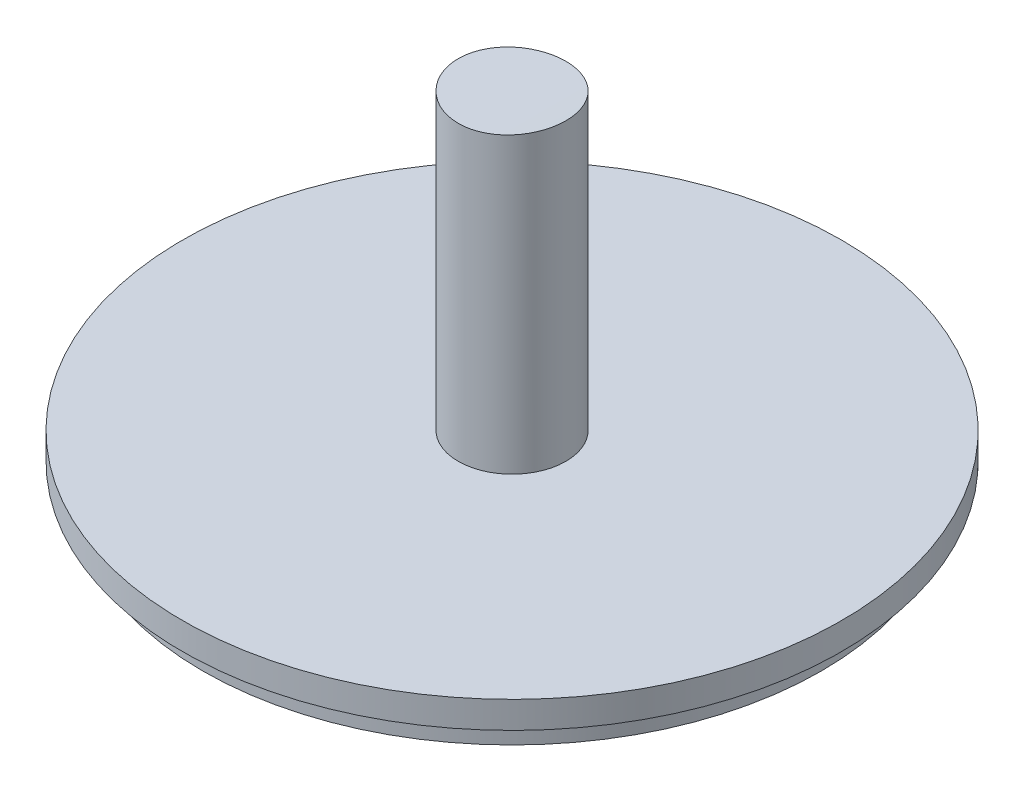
from build123d import *

# Parameters (mm, degrees)
SKETCH2_R           = 12.7
BOSS_EXTRUDE1_DEPTH = 76.2
SKETCH4_R           = 149.9997
CUT_EXTRUDE1_DEPTH  = 38.1


with BuildPart() as part:
    # Sketch1 → Revolve1 (revolve)
    with BuildSketch(Plane.XY, mode=Mode.PRIVATE) as revolve1_sk:
        Polygon((0, 0), (72.9996, 0), (72.9996, 6.35), (77.7748, 6.35), (77.7748, 12.7), (0, 12.7), align=None)
    revolve(revolve1_sk.sketch.rotate(Axis((0, 0, 0), (0, 1, 0)), 90), axis=Axis((0, 0, 0), (0, 1, 0)))

    # Sketch2 → Boss-Extrude1 (add)
    with BuildSketch(Plane(origin=(0, 12.7, 0), x_dir=(1, 0, 0), z_dir=(0, 1, 0))):
        with Locations(Location((0, 0, 0), (0, 0, 90))):
            Circle(SKETCH2_R)
    extrude(amount=BOSS_EXTRUDE1_DEPTH)

    # Sketch4 → Cut-Extrude1 (cut, symmetric)
    with BuildSketch(Plane.XY):
        with Locations((0, 231.775)):
            Circle(SKETCH4_R)
    extrude(amount=CUT_EXTRUDE1_DEPTH, both=True, mode=Mode.SUBTRACT)


solid = part.part
